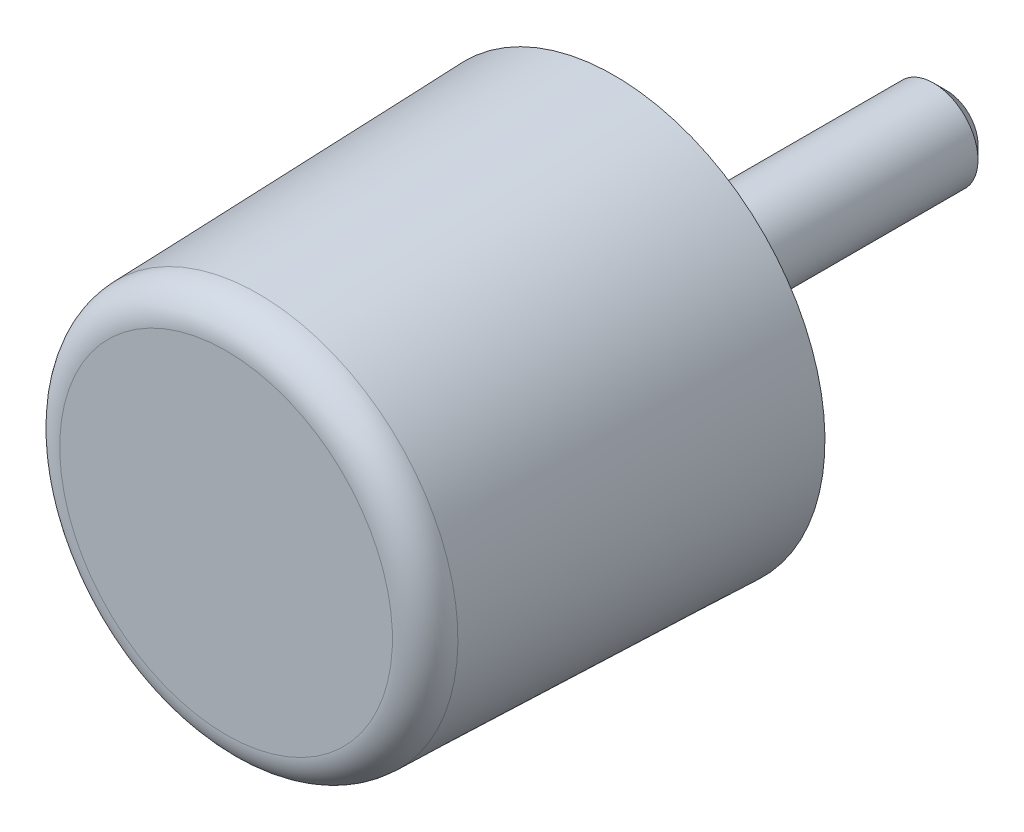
ISO-10303-21;
HEADER;
FILE_DESCRIPTION(('STEP AP214'),'2;1');
FILE_NAME('part.step','',(''),(''),'','','');
FILE_SCHEMA(('AUTOMOTIVE_DESIGN { 1 0 10303 214 1 1 1 1 }'));
ENDSEC;
DATA;
#1=APPLICATION_CONTEXT('core data for automotive mechanical design processes');
#2=APPLICATION_PROTOCOL_DEFINITION('international standard','automotive_design',2000,#1);
#3=PRODUCT_CONTEXT('',#1,'mechanical');
#4=PRODUCT('Part','Part','',(#3));
#5=PRODUCT_RELATED_PRODUCT_CATEGORY('part','',(#4));
#6=PRODUCT_DEFINITION_FORMATION('','',#4);
#7=PRODUCT_DEFINITION_CONTEXT('part definition',#1,'design');
#8=PRODUCT_DEFINITION('design','',#6,#7);
#9=PRODUCT_DEFINITION_SHAPE('','',#8);
#10=(LENGTH_UNIT() NAMED_UNIT(*) SI_UNIT(.MILLI.,.METRE.));
#11=(NAMED_UNIT(*) PLANE_ANGLE_UNIT() SI_UNIT($,.RADIAN.));
#12=(NAMED_UNIT(*) SI_UNIT($,.STERADIAN.) SOLID_ANGLE_UNIT());
#13=UNCERTAINTY_MEASURE_WITH_UNIT(LENGTH_MEASURE(1.E-05),#10,'distance_accuracy_value','');
#14=(GEOMETRIC_REPRESENTATION_CONTEXT(3) GLOBAL_UNCERTAINTY_ASSIGNED_CONTEXT((#13)) GLOBAL_UNIT_ASSIGNED_CONTEXT((#10,
#11,#12)) REPRESENTATION_CONTEXT('',''));
#15=CARTESIAN_POINT('',(0.,0.,0.));
#16=DIRECTION('',(0.,0.,1.));
#17=DIRECTION('',(1.,0.,0.));
#18=AXIS2_PLACEMENT_3D('',#15,#16,#17);
#19=CARTESIAN_POINT('',(0.,0.,35.));
#20=DIRECTION('',(0.,0.,1.));
#21=DIRECTION('',(0.,-1.,0.));
#22=AXIS2_PLACEMENT_3D('',#19,#20,#21);
#23=CYLINDRICAL_SURFACE('',#22,17.1);
#24=CARTESIAN_POINT('',(0.,0.,0.));
#25=DIRECTION('',(0.,0.,1.));
#26=DIRECTION('',(0.,-1.,0.));
#27=AXIS2_PLACEMENT_3D('',#24,#25,#26);
#28=CIRCLE('',#27,17.1);
#29=CARTESIAN_POINT('',(0.,-17.1,0.));
#30=VERTEX_POINT('',#29);
#31=EDGE_CURVE('E27',#30,#30,#28,.T.);
#32=ORIENTED_EDGE('',*,*,#31,.F.);
#33=EDGE_LOOP('',(#32));
#34=FACE_BOUND('',#33,.T.);
#35=CARTESIAN_POINT('',(0.,0.,0.0500000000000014));
#36=DIRECTION('',(0.,0.,1.));
#37=DIRECTION('',(0.,-1.,0.));
#38=AXIS2_PLACEMENT_3D('',#35,#36,#37);
#39=CIRCLE('',#38,17.1);
#40=CARTESIAN_POINT('',(0.,-17.1,0.0500000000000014));
#41=VERTEX_POINT('',#40);
#42=EDGE_CURVE('E44',#41,#41,#39,.T.);
#43=ORIENTED_EDGE('',*,*,#42,.T.);
#44=EDGE_LOOP('',(#43));
#45=FACE_BOUND('',#44,.T.);
#46=ADVANCED_FACE('F12',(#34,#45),#23,.F.);
#47=CARTESIAN_POINT('',(17.1,0.,0.));
#48=DIRECTION('',(0.,0.,1.));
#49=DIRECTION('',(0.,-1.,0.));
#50=AXIS2_PLACEMENT_3D('',#47,#48,#49);
#51=PLANE('',#50);
#52=CARTESIAN_POINT('',(0.,0.,0.));
#53=DIRECTION('',(0.,0.,1.));
#54=DIRECTION('',(0.,-1.,0.));
#55=AXIS2_PLACEMENT_3D('',#52,#53,#54);
#56=CIRCLE('',#55,19.);
#57=CARTESIAN_POINT('',(0.,-19.,0.));
#58=VERTEX_POINT('',#57);
#59=EDGE_CURVE('E32',#58,#58,#56,.T.);
#60=ORIENTED_EDGE('',*,*,#59,.F.);
#61=EDGE_LOOP('',(#60));
#62=FACE_BOUND('',#61,.T.);
#63=ORIENTED_EDGE('',*,*,#31,.T.);
#64=EDGE_LOOP('',(#63));
#65=FACE_BOUND('',#64,.T.);
#66=ADVANCED_FACE('F72',(#62,#65),#51,.F.);
#67=CARTESIAN_POINT('',(0.,0.,0.));
#68=DIRECTION('',(0.,0.,-1.));
#69=DIRECTION('',(0.,1.,0.));
#70=AXIS2_PLACEMENT_3D('',#67,#68,#69);
#71=CONICAL_SURFACE('',#70,19.,0.0311942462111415);
#72=CARTESIAN_POINT('',(0.,0.,32.0935675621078));
#73=DIRECTION('',(0.,0.,1.));
#74=DIRECTION('',(0.,-1.,0.));
#75=AXIS2_PLACEMENT_3D('',#72,#73,#74);
#76=CIRCLE('',#75,17.9985404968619);
#77=CARTESIAN_POINT('',(0.,-17.9985404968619,32.0935675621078));
#78=VERTEX_POINT('',#77);
#79=EDGE_CURVE('E35',#78,#78,#76,.T.);
#80=ORIENTED_EDGE('',*,*,#79,.F.);
#81=EDGE_LOOP('',(#80));
#82=FACE_BOUND('',#81,.T.);
#83=ORIENTED_EDGE('',*,*,#59,.T.);
#84=EDGE_LOOP('',(#83));
#85=FACE_BOUND('',#84,.T.);
#86=ADVANCED_FACE('F77',(#82,#85),#71,.T.);
#87=CARTESIAN_POINT('',(0.,0.,32.));
#88=DIRECTION('',(0.,0.,1.));
#89=DIRECTION('',(0.,-1.,0.));
#90=AXIS2_PLACEMENT_3D('',#87,#88,#89);
#91=TOROIDAL_SURFACE('',#90,15.,3.);
#92=ORIENTED_EDGE('',*,*,#79,.T.);
#93=EDGE_LOOP('',(#92));
#94=FACE_BOUND('',#93,.T.);
#95=CARTESIAN_POINT('',(0.,0.,35.));
#96=DIRECTION('',(0.,0.,1.));
#97=DIRECTION('',(0.,-1.,0.));
#98=AXIS2_PLACEMENT_3D('',#95,#96,#97);
#99=CIRCLE('',#98,15.);
#100=CARTESIAN_POINT('',(0.,-15.,35.));
#101=VERTEX_POINT('',#100);
#102=EDGE_CURVE('E38',#101,#101,#99,.T.);
#103=ORIENTED_EDGE('',*,*,#102,.F.);
#104=EDGE_LOOP('',(#103));
#105=FACE_BOUND('',#104,.T.);
#106=ADVANCED_FACE('F84',(#94,#105),#91,.T.);
#107=CARTESIAN_POINT('',(15.,0.,35.));
#108=DIRECTION('',(0.,0.,-1.));
#109=DIRECTION('',(0.,1.,0.));
#110=AXIS2_PLACEMENT_3D('',#107,#108,#109);
#111=PLANE('',#110);
#112=ORIENTED_EDGE('',*,*,#102,.T.);
#113=EDGE_LOOP('',(#112));
#114=FACE_BOUND('',#113,.T.);
#115=ADVANCED_FACE('F59',(#114),#111,.F.);
#116=CARTESIAN_POINT('',(0.,0.,0.));
#117=DIRECTION('',(0.,0.,1.));
#118=DIRECTION('',(0.,-1.,0.));
#119=AXIS2_PLACEMENT_3D('',#116,#117,#118);
#120=PLANE('',#119);
#121=CARTESIAN_POINT('',(0.,0.,0.));
#122=DIRECTION('',(0.,0.,1.));
#123=DIRECTION('',(0.,-1.,0.));
#124=AXIS2_PLACEMENT_3D('',#121,#122,#123);
#125=CIRCLE('',#124,17.05);
#126=CARTESIAN_POINT('',(0.,-17.05,0.));
#127=VERTEX_POINT('',#126);
#128=EDGE_CURVE('E41',#127,#127,#125,.T.);
#129=ORIENTED_EDGE('',*,*,#128,.F.);
#130=EDGE_LOOP('',(#129));
#131=FACE_BOUND('',#130,.T.);
#132=CARTESIAN_POINT('',(0.,0.,0.));
#133=DIRECTION('',(0.,0.,1.));
#134=DIRECTION('',(0.,-1.,0.));
#135=AXIS2_PLACEMENT_3D('',#132,#133,#134);
#136=CIRCLE('',#135,4.);
#137=CARTESIAN_POINT('',(0.,-4.,0.));
#138=VERTEX_POINT('',#137);
#139=EDGE_CURVE('E23',#138,#138,#136,.T.);
#140=ORIENTED_EDGE('',*,*,#139,.T.);
#141=EDGE_LOOP('',(#140));
#142=FACE_BOUND('',#141,.T.);
#143=ADVANCED_FACE('F53',(#131,#142),#120,.F.);
#144=CARTESIAN_POINT('',(0.,0.,0.));
#145=DIRECTION('',(0.,0.,1.));
#146=DIRECTION('',(0.,-1.,0.));
#147=AXIS2_PLACEMENT_3D('',#144,#145,#146);
#148=CONICAL_SURFACE('',#147,17.05,0.785398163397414);
#149=ORIENTED_EDGE('',*,*,#42,.F.);
#150=EDGE_LOOP('',(#149));
#151=FACE_BOUND('',#150,.T.);
#152=ORIENTED_EDGE('',*,*,#128,.T.);
#153=EDGE_LOOP('',(#152));
#154=FACE_BOUND('',#153,.T.);
#155=ADVANCED_FACE('F49',(#151,#154),#148,.T.);
#156=CARTESIAN_POINT('',(0.,0.,35.));
#157=DIRECTION('',(0.,0.,1.));
#158=DIRECTION('',(0.,-1.,0.));
#159=AXIS2_PLACEMENT_3D('',#156,#157,#158);
#160=CYLINDRICAL_SURFACE('',#159,4.);
#161=CARTESIAN_POINT('',(0.,0.,-28.8));
#162=DIRECTION('',(0.,0.,-1.));
#163=DIRECTION('',(0.,1.,0.));
#164=AXIS2_PLACEMENT_3D('',#161,#162,#163);
#165=CIRCLE('',#164,4.);
#166=CARTESIAN_POINT('',(0.,4.,-28.8));
#167=VERTEX_POINT('',#166);
#168=EDGE_CURVE('E8',#167,#167,#165,.F.);
#169=ORIENTED_EDGE('',*,*,#168,.T.);
#170=EDGE_LOOP('',(#169));
#171=FACE_BOUND('',#170,.T.);
#172=ORIENTED_EDGE('',*,*,#139,.F.);
#173=EDGE_LOOP('',(#172));
#174=FACE_BOUND('',#173,.T.);
#175=ADVANCED_FACE('F52',(#171,#174),#160,.T.);
#176=CARTESIAN_POINT('',(0.,0.,-30.));
#177=DIRECTION('',(0.,0.,-1.));
#178=DIRECTION('',(0.,1.,0.));
#179=AXIS2_PLACEMENT_3D('',#176,#177,#178);
#180=PLANE('',#179);
#181=CARTESIAN_POINT('',(0.,0.,-30.));
#182=DIRECTION('',(0.,0.,-1.));
#183=DIRECTION('',(0.,1.,0.));
#184=AXIS2_PLACEMENT_3D('',#181,#182,#183);
#185=CIRCLE('',#184,2.8);
#186=CARTESIAN_POINT('',(0.,2.8,-30.));
#187=VERTEX_POINT('',#186);
#188=EDGE_CURVE('E19',#187,#187,#185,.T.);
#189=ORIENTED_EDGE('',*,*,#188,.T.);
#190=EDGE_LOOP('',(#189));
#191=FACE_BOUND('',#190,.T.);
#192=ADVANCED_FACE('F64',(#191),#180,.T.);
#193=CARTESIAN_POINT('',(0.,0.,-30.));
#194=DIRECTION('',(0.,0.,1.));
#195=DIRECTION('',(0.,-1.,0.));
#196=AXIS2_PLACEMENT_3D('',#193,#194,#195);
#197=CONICAL_SURFACE('',#196,2.8,0.78539816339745);
#198=ORIENTED_EDGE('',*,*,#168,.F.);
#199=EDGE_LOOP('',(#198));
#200=FACE_BOUND('',#199,.T.);
#201=ORIENTED_EDGE('',*,*,#188,.F.);
#202=EDGE_LOOP('',(#201));
#203=FACE_BOUND('',#202,.T.);
#204=ADVANCED_FACE('F14',(#200,#203),#197,.T.);
#205=CLOSED_SHELL('',(#46,#66,#86,#106,#115,#143,#155,#175,#192,#204));
#206=MANIFOLD_SOLID_BREP('B1',#205);
#207=ADVANCED_BREP_SHAPE_REPRESENTATION('',(#18,#206),#14);
#208=SHAPE_DEFINITION_REPRESENTATION(#9,#207);
ENDSEC;
END-ISO-10303-21;
